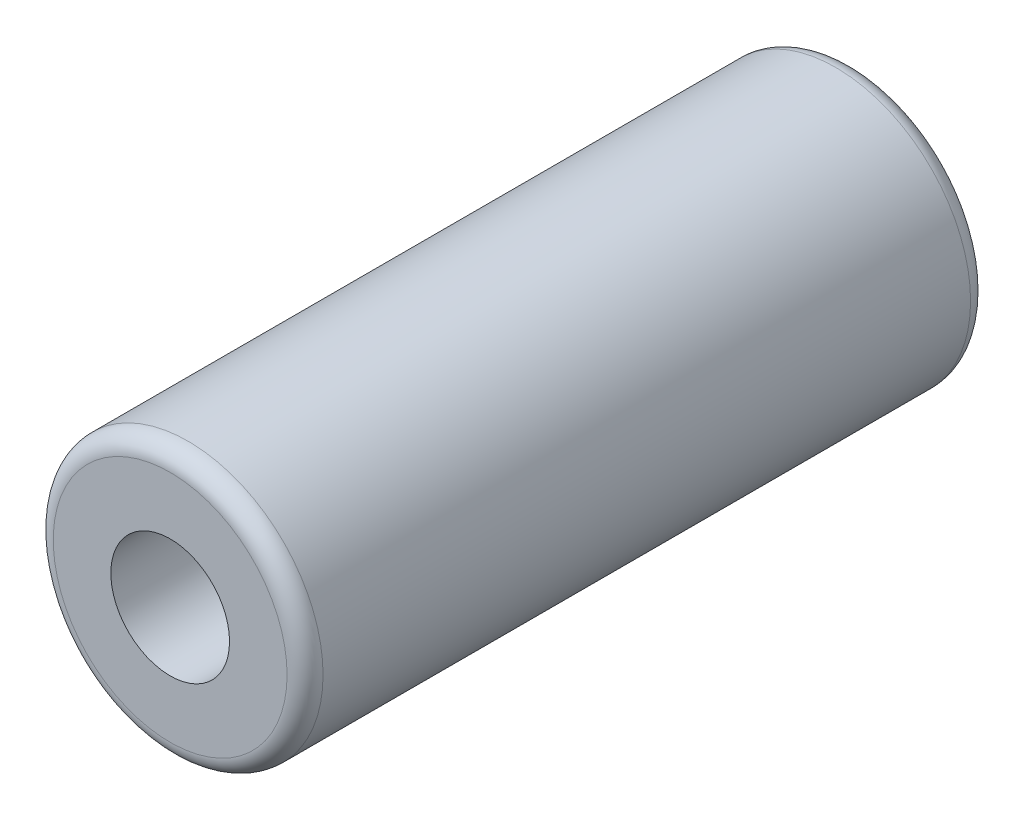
from build123d import *

# Parameters (mm, degrees)
ESQUISSE1_R             = 37.5
EXTRUSION1_DEPTH        = 190
ENL_V_MAT_EXTRU_1_REACH = 199.263
ESQUISSE2_R             = 16.5
CONG_1_R                = 5


with BuildPart() as part:
    # Esquisse1 → Extrusion1 (new body)
    with BuildSketch(Plane.XY):
        Circle(ESQUISSE1_R)
    extrude(amount=EXTRUSION1_DEPTH)

    # Esquisse2 → Enl_v. mat.-Extru.1 (cut, up to next)
    with BuildSketch(Plane.XY.offset(190), mode=Mode.PRIVATE) as enl_v_mat_extru_1_sk1:
        Circle(ESQUISSE2_R)
    enl_v_mat_extru_1_tool1 = extrude(enl_v_mat_extru_1_sk1.sketch, amount=-ENL_V_MAT_EXTRU_1_REACH, mode=Mode.PRIVATE) & part.part
    add(enl_v_mat_extru_1_tool1.solids().sort_by_distance((0, 0, 190))[0], mode=Mode.SUBTRACT)

    # Cong_1
    cong_1_edges = [part.edges().sort_by_distance(p)[0] for p in [
        (-37.5, 0, 0),
        (-37.5, 0, 190),
    ]]
    fillet(cong_1_edges, radius=CONG_1_R)


solid = part.part
